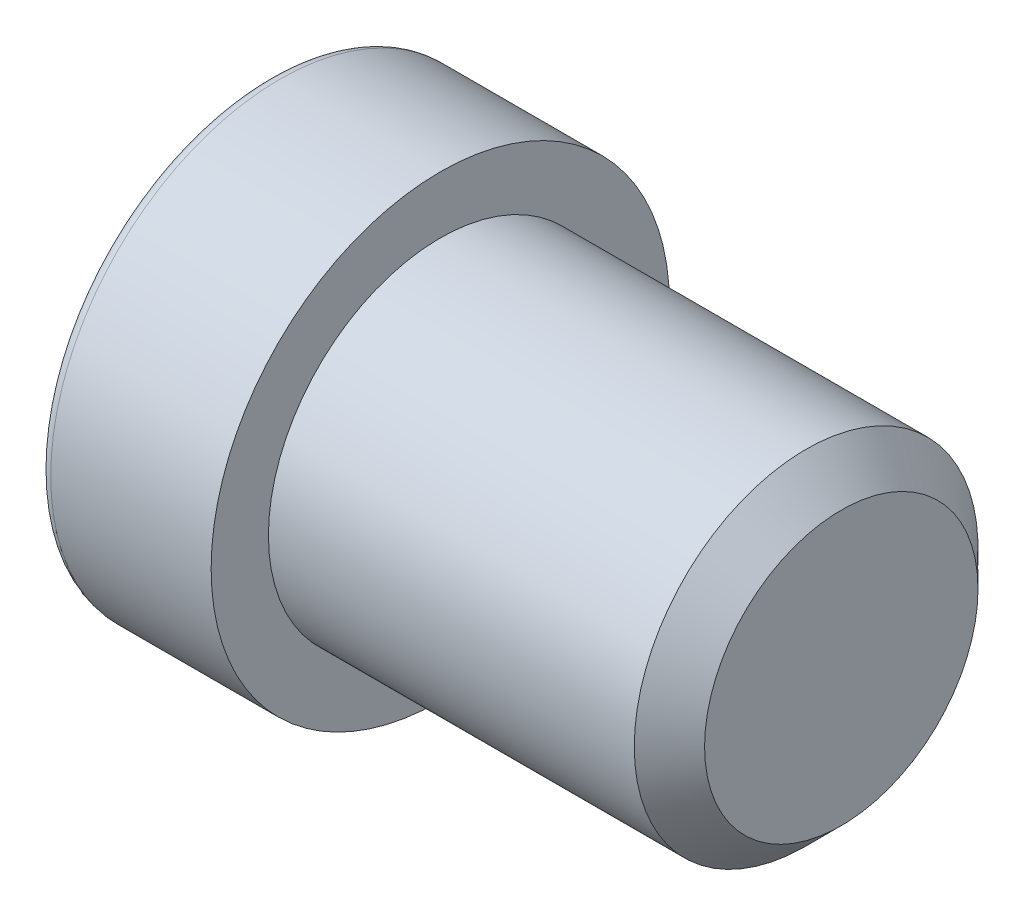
from build123d import *

# Parameters (mm, degrees)
CUT_EXTRUDE_1_DEPTH = 1


with BuildPart() as part:
    # Sketch 1 → Revolve 1 (revolve)
    with BuildSketch(Plane.XY, mode=Mode.PRIVATE) as revolve_1_sk:
        with BuildLine():
            Line((-3, 0), (-3, 3.8))
            ThreePointArc((-3, 3.8), (-2.941421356, 3.941421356), (-2.8, 4))
            Line((-2.8, 4), (0, 4))
            Line((0, 4), (0, 3))
            Line((0, 3), (6.3865, 3))
            Line((6.3865, 3), (7, 2.3865))
            Line((7, 2.3865), (7, 0))
            Line((7, 0), (-3, 0))
        make_face()
    revolve(revolve_1_sk.sketch.rotate(Axis((7, 0, 0), (-1, 0, 0)), 270), axis=Axis((7, 0, 0), (-1, 0, 0)))

    # Sketch 2 → Cut-Extrude 1 (cut)
    with BuildSketch(Plane.ZY.offset(3)):
        Polygon((1.154700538, -2), (2.309401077, 0), (1.154700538, 2), (-1.154700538, 2), (-2.309401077, 0), (-1.154700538, -2), align=None)
    extrude(amount=-CUT_EXTRUDE_1_DEPTH, mode=Mode.SUBTRACT)


solid = part.part
